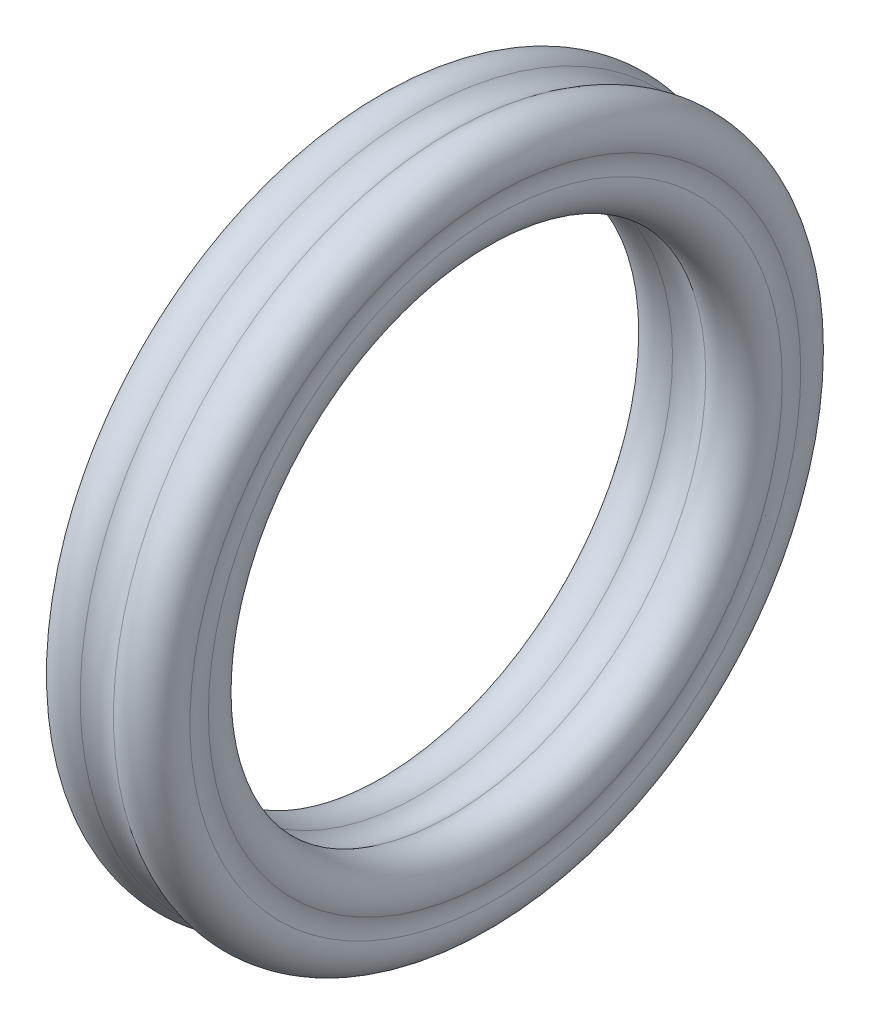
from build123d import *


with BuildPart() as part:
    # Esquisse1 → Base-R_volution (revolve)
    with BuildSketch(Plane.XY, mode=Mode.PRIVATE) as base_r_volution_sk:
        with BuildLine():
            ThreePointArc((14.58166418, 5.457785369), (14.036286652, 5.45144704), (13.874811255, 4.930483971))
            ThreePointArc((13.874811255, 4.930483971), (13.899622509, 4.780898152), (13.874811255, 4.631312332))
            ThreePointArc((13.874811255, 4.631312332), (14.036286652, 4.110349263), (14.58166418, 4.104010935))
            ThreePointArc((14.58166418, 4.104010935), (14.85, 4.189623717), (15.11833582, 4.104010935))
            ThreePointArc((15.11833582, 4.104010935), (15.663713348, 4.110349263), (15.825188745, 4.631312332))
            ThreePointArc((15.825188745, 4.631312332), (15.800377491, 4.780898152), (15.825188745, 4.930483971))
            ThreePointArc((15.825188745, 4.930483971), (15.663713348, 5.45144704), (15.11833582, 5.457785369))
            ThreePointArc((15.11833582, 5.457785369), (14.85, 5.372172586), (14.58166418, 5.457785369))
        make_face()
    revolve(base_r_volution_sk.sketch.rotate(Axis((14.85, 0, 0), (-1, 0, 0)), 90), axis=Axis((14.85, 0, 0), (-1, 0, 0)))


solid = part.part
